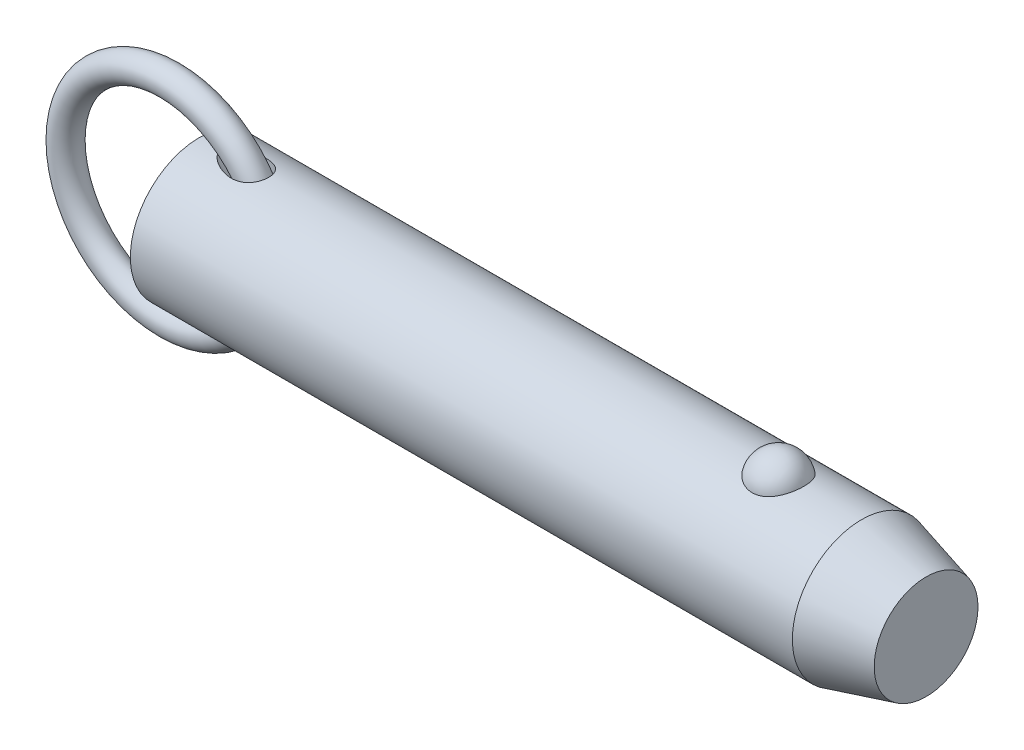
ISO-10303-21;
HEADER;
FILE_DESCRIPTION(('STEP AP214'),'2;1');
FILE_NAME('part.step','',(''),(''),'','','');
FILE_SCHEMA(('AUTOMOTIVE_DESIGN { 1 0 10303 214 1 1 1 1 }'));
ENDSEC;
DATA;
#1=APPLICATION_CONTEXT('core data for automotive mechanical design processes');
#2=APPLICATION_PROTOCOL_DEFINITION('international standard','automotive_design',2000,#1);
#3=PRODUCT_CONTEXT('',#1,'mechanical');
#4=PRODUCT('Part','Part','',(#3));
#5=PRODUCT_RELATED_PRODUCT_CATEGORY('part','',(#4));
#6=PRODUCT_DEFINITION_FORMATION('','',#4);
#7=PRODUCT_DEFINITION_CONTEXT('part definition',#1,'design');
#8=PRODUCT_DEFINITION('design','',#6,#7);
#9=PRODUCT_DEFINITION_SHAPE('','',#8);
#10=(LENGTH_UNIT() NAMED_UNIT(*) SI_UNIT(.MILLI.,.METRE.));
#11=(NAMED_UNIT(*) PLANE_ANGLE_UNIT() SI_UNIT($,.RADIAN.));
#12=(NAMED_UNIT(*) SI_UNIT($,.STERADIAN.) SOLID_ANGLE_UNIT());
#13=UNCERTAINTY_MEASURE_WITH_UNIT(LENGTH_MEASURE(1.E-05),#10,'distance_accuracy_value','');
#14=(GEOMETRIC_REPRESENTATION_CONTEXT(3) GLOBAL_UNCERTAINTY_ASSIGNED_CONTEXT((#13)) GLOBAL_UNIT_ASSIGNED_CONTEXT((#10,
#11,#12)) REPRESENTATION_CONTEXT('',''));
#15=CARTESIAN_POINT('',(0.,0.,0.));
#16=DIRECTION('',(0.,0.,1.));
#17=DIRECTION('',(1.,0.,0.));
#18=AXIS2_PLACEMENT_3D('',#15,#16,#17);
#19=CARTESIAN_POINT('',(-5.53898640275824,0.,0.));
#20=DIRECTION('',(0.,0.,1.));
#21=DIRECTION('',(1.,0.,0.));
#22=AXIS2_PLACEMENT_3D('',#19,#20,#21);
#23=TOROIDAL_SURFACE('',#22,19.05,2.54);
#24=CARTESIAN_POINT('',(16.0510135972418,0.,0.));
#25=VERTEX_POINT('',#24);
#26=VERTEX_LOOP('',#25);
#27=FACE_BOUND('',#26,.T.);
#28=ADVANCED_FACE('P0_F12',(#27),#23,.T.);
#29=CLOSED_SHELL('',(#28));
#30=MANIFOLD_SOLID_BREP('P0_B1',#29);
#31=CARTESIAN_POINT('',(0.,0.,0.));
#32=DIRECTION('',(1.,0.,0.));
#33=DIRECTION('',(0.,0.,-1.));
#34=AXIS2_PLACEMENT_3D('',#31,#32,#33);
#35=CYLINDRICAL_SURFACE('',#34,12.7);
#36=CARTESIAN_POINT('',(121.500738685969,0.,0.));
#37=DIRECTION('',(1.,0.,0.));
#38=DIRECTION('',(0.,0.,-1.));
#39=AXIS2_PLACEMENT_3D('',#36,#37,#38);
#40=CIRCLE('',#39,12.7);
#41=CARTESIAN_POINT('',(121.500738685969,0.,-12.7));
#42=VERTEX_POINT('',#41);
#43=EDGE_CURVE('P1_E89',#42,#42,#40,.T.);
#44=ORIENTED_EDGE('',*,*,#43,.F.);
#45=EDGE_LOOP('',(#44));
#46=FACE_BOUND('',#45,.T.);
#47=CARTESIAN_POINT('',(0.,0.,0.));
#48=DIRECTION('',(1.,0.,0.));
#49=DIRECTION('',(0.,0.,-1.));
#50=AXIS2_PLACEMENT_3D('',#47,#48,#49);
#51=CIRCLE('',#50,12.7);
#52=CARTESIAN_POINT('',(0.,0.,-12.7));
#53=VERTEX_POINT('',#52);
#54=EDGE_CURVE('P1_E52',#53,#53,#51,.T.);
#55=ORIENTED_EDGE('',*,*,#54,.T.);
#56=EDGE_LOOP('',(#55));
#57=FACE_BOUND('',#56,.T.);
#58=CARTESIAN_POINT('',(106.260042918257,11.7500437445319,4.81938502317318));
#59=CARTESIAN_POINT('',(106.135088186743,11.7500430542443,4.81938571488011));
#60=CARTESIAN_POINT('',(106.010144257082,11.7520975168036,4.81438658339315));
#61=CARTESIAN_POINT('',(105.761142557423,11.760253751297,4.79442904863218));
#62=CARTESIAN_POINT('',(105.637085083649,11.7663568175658,4.77946746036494));
#63=CARTESIAN_POINT('',(105.390901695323,11.7824262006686,4.7397141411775));
#64=CARTESIAN_POINT('',(105.268774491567,11.7923898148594,4.71492928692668));
#65=CARTESIAN_POINT('',(105.027187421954,11.8158938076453,4.65571340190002));
#66=CARTESIAN_POINT('',(104.90772859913,11.8294355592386,4.6212786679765));
#67=CARTESIAN_POINT('',(104.672557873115,11.8596812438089,4.54309502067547));
#68=CARTESIAN_POINT('',(104.556839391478,11.8763792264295,4.49936361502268));
#69=CARTESIAN_POINT('',(104.329653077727,11.9124878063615,4.40287235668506));
#70=CARTESIAN_POINT('',(104.218186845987,11.9318994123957,4.35010914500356));
#71=CARTESIAN_POINT('',(103.891278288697,11.9934256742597,4.17881316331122));
#72=CARTESIAN_POINT('',(103.683127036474,12.038858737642,4.04720756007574));
#73=CARTESIAN_POINT('',(103.285850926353,12.1352173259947,3.748564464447));
#74=CARTESIAN_POINT('',(103.097443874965,12.1862630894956,3.58061821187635));
#75=CARTESIAN_POINT('',(102.750521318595,12.2875163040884,3.21600758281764));
#76=CARTESIAN_POINT('',(102.592011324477,12.3377235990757,3.0193379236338));
#77=CARTESIAN_POINT('',(102.30168878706,12.434492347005,2.592916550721));
#78=CARTESIAN_POINT('',(102.171376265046,12.4807925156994,2.36208286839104));
#79=CARTESIAN_POINT('',(101.949407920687,12.5623454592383,1.88070399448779));
#80=CARTESIAN_POINT('',(101.857755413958,12.5975972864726,1.63015711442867));
#81=CARTESIAN_POINT('',(101.714046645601,12.6538414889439,1.1129886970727));
#82=CARTESIAN_POINT('',(101.662499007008,12.6746503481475,0.846205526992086));
#83=CARTESIAN_POINT('',(101.601977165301,12.699153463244,0.307085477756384));
#84=CARTESIAN_POINT('',(101.593001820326,12.7028481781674,0.0347487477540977));
#85=CARTESIAN_POINT('',(101.617731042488,12.6927785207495,-0.506073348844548));
#86=CARTESIAN_POINT('',(101.651189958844,12.6791146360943,-0.77457186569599));
#87=CARTESIAN_POINT('',(101.759687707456,12.635882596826,-1.30170246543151));
#88=CARTESIAN_POINT('',(101.83472729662,12.606314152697,-1.5603343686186));
#89=CARTESIAN_POINT('',(102.02500006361,12.5342328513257,-2.06083899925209));
#90=CARTESIAN_POINT('',(102.140287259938,12.4917026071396,-2.3026886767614));
#91=CARTESIAN_POINT('',(102.408704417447,12.3981123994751,-2.76259600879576));
#92=CARTESIAN_POINT('',(102.561837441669,12.3470517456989,-2.98065173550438));
#93=CARTESIAN_POINT('',(102.903507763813,12.2416045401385,-3.38786328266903));
#94=CARTESIAN_POINT('',(103.092201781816,12.1872040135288,-3.57688418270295));
#95=CARTESIAN_POINT('',(103.500239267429,12.0814086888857,-3.91941073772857));
#96=CARTESIAN_POINT('',(103.719580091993,12.0300136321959,-4.07291945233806));
#97=CARTESIAN_POINT('',(104.178375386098,11.9373542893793,-4.33691289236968));
#98=CARTESIAN_POINT('',(104.417304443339,11.8958982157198,-4.44824125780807));
#99=CARTESIAN_POINT('',(104.91243761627,11.8268116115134,-4.62881985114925));
#100=CARTESIAN_POINT('',(105.168635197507,11.7991758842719,-4.69808589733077));
#101=CARTESIAN_POINT('',(105.677164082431,11.7622209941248,-4.78983181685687));
#102=CARTESIAN_POINT('',(105.929041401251,11.7520502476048,-4.81449025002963));
#103=CARTESIAN_POINT('',(106.433573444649,11.7485796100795,-4.82295735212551));
#104=CARTESIAN_POINT('',(106.686228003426,11.7552763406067,-4.80677420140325));
#105=CARTESIAN_POINT('',(107.176834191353,11.7842584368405,-4.73525430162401));
#106=CARTESIAN_POINT('',(107.414998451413,11.8060486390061,-4.68116061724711));
#107=CARTESIAN_POINT('',(107.878489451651,11.8622750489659,-4.53678133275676));
#108=CARTESIAN_POINT('',(108.103815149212,11.8967122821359,-4.44649279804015));
#109=CARTESIAN_POINT('',(108.540801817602,11.9754603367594,-4.2298761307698));
#110=CARTESIAN_POINT('',(108.752057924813,12.0199699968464,-4.10280539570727));
#111=CARTESIAN_POINT('',(109.150601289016,12.1138028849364,-3.81685409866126));
#112=CARTESIAN_POINT('',(109.337883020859,12.163127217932,-3.65796622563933));
#113=CARTESIAN_POINT('',(109.693350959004,12.2642343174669,-3.30364864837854));
#114=CARTESIAN_POINT('',(109.860111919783,12.3160165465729,-3.10678783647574));
#115=CARTESIAN_POINT('',(110.159579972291,12.4142566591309,-2.68748409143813));
#116=CARTESIAN_POINT('',(110.292280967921,12.4607135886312,-2.46503658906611));
#117=CARTESIAN_POINT('',(110.524691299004,12.5450236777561,-1.9928951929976));
#118=CARTESIAN_POINT('',(110.623215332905,12.5825557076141,-1.7425591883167));
#119=CARTESIAN_POINT('',(110.779227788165,12.6431720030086,-1.22773734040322));
#120=CARTESIAN_POINT('',(110.836715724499,12.6662560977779,-0.963251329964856));
#121=CARTESIAN_POINT('',(110.909544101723,12.6956486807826,-0.427355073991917));
#122=CARTESIAN_POINT('',(110.924837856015,12.7019385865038,-0.155937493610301));
#123=CARTESIAN_POINT('',(110.912779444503,12.6970201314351,0.385928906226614));
#124=CARTESIAN_POINT('',(110.88542805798,12.6858120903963,0.656377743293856));
#125=CARTESIAN_POINT('',(110.813060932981,12.6568455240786,1.05454017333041));
#126=CARTESIAN_POINT('',(110.783796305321,12.6451962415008,1.18577850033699));
#127=CARTESIAN_POINT('',(110.715022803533,12.6181819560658,1.4451380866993));
#128=CARTESIAN_POINT('',(110.675517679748,12.6028183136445,1.57326046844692));
#129=CARTESIAN_POINT('',(110.586439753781,12.5687547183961,1.82554978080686));
#130=CARTESIAN_POINT('',(110.536862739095,12.5500533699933,1.9497150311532));
#131=CARTESIAN_POINT('',(110.42792115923,12.5098093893,2.1931437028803));
#132=CARTESIAN_POINT('',(110.368560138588,12.4882677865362,2.31240887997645));
#133=CARTESIAN_POINT('',(110.23997128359,12.4427679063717,2.54593031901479));
#134=CARTESIAN_POINT('',(110.170688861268,12.4187964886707,2.66015396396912));
#135=CARTESIAN_POINT('',(110.022903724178,12.3691892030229,2.88202659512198));
#136=CARTESIAN_POINT('',(109.944404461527,12.3435539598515,2.98967802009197));
#137=CARTESIAN_POINT('',(109.778550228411,12.2912955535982,3.19774385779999));
#138=CARTESIAN_POINT('',(109.691191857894,12.2646720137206,3.29815546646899));
#139=CARTESIAN_POINT('',(109.508161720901,12.2111945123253,3.49095035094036));
#140=CARTESIAN_POINT('',(109.412493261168,12.1843406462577,3.58333679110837));
#141=CARTESIAN_POINT('',(109.213627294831,12.1312249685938,3.75922876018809));
#142=CARTESIAN_POINT('',(109.110450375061,12.104961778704,3.84275713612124));
#143=CARTESIAN_POINT('',(108.89701336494,12.0537284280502,4.00056406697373));
#144=CARTESIAN_POINT('',(108.786756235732,12.028757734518,4.07484645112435));
#145=CARTESIAN_POINT('',(108.559755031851,11.9808306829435,4.21367959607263));
#146=CARTESIAN_POINT('',(108.443006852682,11.9578756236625,4.27822410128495));
#147=CARTESIAN_POINT('',(108.20394258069,11.9147184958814,4.39698483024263));
#148=CARTESIAN_POINT('',(108.081628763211,11.894515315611,4.45120522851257));
#149=CARTESIAN_POINT('',(107.822952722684,11.8561129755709,4.55255353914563));
#150=CARTESIAN_POINT('',(107.686223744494,11.8381764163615,4.59884858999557));
#151=CARTESIAN_POINT('',(107.408608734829,11.8069093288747,4.67853897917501));
#152=CARTESIAN_POINT('',(107.267724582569,11.7935767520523,4.71194005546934));
#153=CARTESIAN_POINT('',(106.98309446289,11.7720277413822,4.76552188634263));
#154=CARTESIAN_POINT('',(106.839348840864,11.7638106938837,4.78570422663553));
#155=CARTESIAN_POINT('',(106.550411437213,11.7528195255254,4.81263433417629));
#156=CARTESIAN_POINT('',(106.405219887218,11.7500445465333,4.81938421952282));
#157=CARTESIAN_POINT('',(106.260042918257,11.7500437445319,4.81938502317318));
#158=B_SPLINE_CURVE_WITH_KNOTS('',3,(#58,#59,#60,#61,#62,#63,#64,#65,#66,#67,#68,#69,#70,#71,
#72,#73,#74,#75,#76,#77,#78,#79,#80,#81,#82,#83,#84,#85,#86,#87,#88,#89,#90,#91,#92,#93,#94,#95,
#96,#97,#98,#99,#100,#101,#102,#103,#104,#105,#106,#107,#108,#109,#110,#111,#112,#113,#114,#115,
#116,#117,#118,#119,#120,#121,#122,#123,#124,#125,#126,#127,#128,#129,#130,#131,#132,#133,#134,
#135,#136,#137,#138,#139,#140,#141,#142,#143,#144,#145,#146,#147,#148,#149,#150,#151,#152,#153,
#154,#155,#156,#157),.UNSPECIFIED.,.T.,.F.,(4,2,2,2,2,2,2,2,2,2,2,2,2,2,2,2,2,2,2,2,2,2,2,2,2,2,
2,2,2,2,2,2,2,2,2,2,2,2,2,2,2,2,2,2,2,2,2,2,2,4),(0.,0.374729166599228,0.749578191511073,
1.12416526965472,1.49889629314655,1.87292776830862,2.24709865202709,2.99481328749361,
3.76399449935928,4.53331735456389,5.3368391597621,6.14042986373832,6.95405296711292,
7.76765424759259,8.57656703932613,9.38549455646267,10.1955119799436,11.0055949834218,
11.8193353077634,12.6330054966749,13.4294141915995,14.2255231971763,14.9815786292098,
15.7374826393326,16.4696948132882,17.2019663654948,17.9501979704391,18.6986017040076,
19.484470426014,20.2704797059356,21.0815215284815,21.8925729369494,22.7045213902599,
23.5164550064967,23.9209608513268,24.3253187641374,24.7298461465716,25.1342272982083,
25.54092555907,25.9474719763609,26.3541750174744,26.7607169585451,27.1661834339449,
27.5714814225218,27.9770386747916,28.3824315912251,28.8181206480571,29.2536155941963,
29.6890582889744,30.1244323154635),.UNSPECIFIED.);
#159=CARTESIAN_POINT('',(106.260042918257,11.7500437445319,4.81938502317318));
#160=VERTEX_POINT('',#159);
#161=EDGE_CURVE('P1_E80',#160,#160,#158,.T.);
#162=ORIENTED_EDGE('',*,*,#161,.T.);
#163=EDGE_LOOP('',(#162));
#164=FACE_BOUND('',#163,.T.);
#165=CARTESIAN_POINT('',(-5.53898640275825,0.,0.));
#166=DIRECTION('',(0.796400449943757,-0.604769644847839,0.));
#167=DIRECTION('',(0.604769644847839,0.796400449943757,0.));
#168=AXIS2_PLACEMENT_3D('',#165,#166,#167);
#169=ELLIPSE('',#168,15.9467514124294,12.7);
#170=CARTESIAN_POINT('',(4.09482149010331,12.6864319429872,0.5868939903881));
#171=VERTEX_POINT('',#170);
#172=CARTESIAN_POINT('',(4.09482149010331,12.6864319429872,-0.5868939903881));
#173=VERTEX_POINT('',#172);
#174=EDGE_CURVE('P1_E47',#171,#173,#169,.F.);
#175=ORIENTED_EDGE('',*,*,#174,.T.);
#176=CARTESIAN_POINT('',(4.06153170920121,12.6905758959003,-0.489166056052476));
#177=CARTESIAN_POINT('',(4.08111374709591,12.6881366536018,-0.552489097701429));
#178=CARTESIAN_POINT('',(4.10417851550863,12.6852663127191,-0.614604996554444));
#179=CARTESIAN_POINT('',(4.15628434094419,12.6787965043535,-0.736067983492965));
#180=CARTESIAN_POINT('',(4.18531032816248,12.6751988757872,-0.795421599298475));
#181=CARTESIAN_POINT('',(4.27911159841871,12.6636052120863,-0.967590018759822));
#182=CARTESIAN_POINT('',(4.35123408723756,12.654730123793,-1.07635920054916));
#183=CARTESIAN_POINT('',(4.49106800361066,12.6376715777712,-1.25922957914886));
#184=CARTESIAN_POINT('',(4.55601066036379,12.6297947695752,-1.33556751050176));
#185=CARTESIAN_POINT('',(4.69223626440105,12.6134116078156,-1.48232741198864));
#186=CARTESIAN_POINT('',(4.76352147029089,12.6049050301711,-1.55274725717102));
#187=CARTESIAN_POINT('',(4.91163946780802,12.587417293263,-1.68868704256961));
#188=CARTESIAN_POINT('',(4.98851399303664,12.5784327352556,-1.75416062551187));
#189=CARTESIAN_POINT('',(5.14630057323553,12.560235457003,-1.88003275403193));
#190=CARTESIAN_POINT('',(5.22721398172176,12.5510226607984,-1.94042957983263));
#191=CARTESIAN_POINT('',(5.45368877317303,12.5256514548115,-2.09966332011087));
#192=CARTESIAN_POINT('',(5.60261616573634,12.5094182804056,-2.19371988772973));
#193=CARTESIAN_POINT('',(5.90795545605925,12.4774211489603,-2.36893890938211));
#194=CARTESIAN_POINT('',(6.064372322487,12.4616575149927,-2.45009264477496));
#195=CARTESIAN_POINT('',(6.3830613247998,12.431227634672,-2.60008249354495));
#196=CARTESIAN_POINT('',(6.54533237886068,12.4165611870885,-2.66892086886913));
#197=CARTESIAN_POINT('',(6.87462618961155,12.3889351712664,-2.79435199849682));
#198=CARTESIAN_POINT('',(7.04164773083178,12.3759751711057,-2.8509478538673));
#199=CARTESIAN_POINT('',(7.38726647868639,12.3518460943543,-2.95377962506));
#200=CARTESIAN_POINT('',(7.56604577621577,12.3407843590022,-2.99943209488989));
#201=CARTESIAN_POINT('',(7.92698692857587,12.3219309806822,-3.07596683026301));
#202=CARTESIAN_POINT('',(8.10914972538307,12.314140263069,-3.10684491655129));
#203=CARTESIAN_POINT('',(8.475114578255,12.3025918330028,-3.152268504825));
#204=CARTESIAN_POINT('',(8.65890979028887,12.2988216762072,-3.16686440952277));
#205=CARTESIAN_POINT('',(9.0269608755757,12.2959421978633,-3.17802250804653));
#206=CARTESIAN_POINT('',(9.21121628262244,12.2968292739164,-3.17459864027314));
#207=CARTESIAN_POINT('',(9.61636263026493,12.3045198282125,-3.14471110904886));
#208=CARTESIAN_POINT('',(9.83695552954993,12.3125080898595,-3.1136323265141));
#209=CARTESIAN_POINT('',(10.1619126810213,12.3303028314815,-3.04206574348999));
#210=CARTESIAN_POINT('',(10.2692747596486,12.3372061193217,-3.01403983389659));
#211=CARTESIAN_POINT('',(10.4811758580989,12.3528538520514,-2.94925947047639));
#212=CARTESIAN_POINT('',(10.5857162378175,12.361597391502,-2.91250930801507));
#213=CARTESIAN_POINT('',(10.7921321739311,12.3808585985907,-2.82951748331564));
#214=CARTESIAN_POINT('',(10.8939665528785,12.3913944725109,-2.78317723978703));
#215=CARTESIAN_POINT('',(11.0926118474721,12.4138762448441,-2.68112002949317));
#216=CARTESIAN_POINT('',(11.1894254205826,12.4258213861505,-2.6254080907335));
#217=CARTESIAN_POINT('',(11.3768740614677,12.4507225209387,-2.5046565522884));
#218=CARTESIAN_POINT('',(11.46751150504,12.4636781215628,-2.43962056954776));
#219=CARTESIAN_POINT('',(11.6414572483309,12.4901070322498,-2.30048560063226));
#220=CARTESIAN_POINT('',(11.7247669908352,12.5035802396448,-2.22638840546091));
#221=CARTESIAN_POINT('',(11.8713131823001,12.5285000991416,-2.08117367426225));
#222=CARTESIAN_POINT('',(11.9357009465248,12.5399538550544,-2.01121596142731));
#223=CARTESIAN_POINT('',(12.0576805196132,12.5624496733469,-1.86555293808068));
#224=CARTESIAN_POINT('',(12.1152732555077,12.5734917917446,-1.78984841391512));
#225=CARTESIAN_POINT('',(12.223073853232,12.5947858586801,-1.63327883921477));
#226=CARTESIAN_POINT('',(12.2732844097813,12.6050380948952,-1.55241568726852));
#227=CARTESIAN_POINT('',(12.3658430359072,12.6243983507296,-1.3862126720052));
#228=CARTESIAN_POINT('',(12.4081916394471,12.6335064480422,-1.30087311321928));
#229=CARTESIAN_POINT('',(12.5150098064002,12.6569076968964,-1.05702619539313));
#230=CARTESIAN_POINT('',(12.5703399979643,12.6695746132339,-0.894232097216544));
#231=CARTESIAN_POINT('',(12.6526225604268,12.6886816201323,-0.561391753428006));
#232=CARTESIAN_POINT('',(12.6795825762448,12.6951233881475,-0.391347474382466));
#233=CARTESIAN_POINT('',(12.7041016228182,12.7009766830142,-0.0537636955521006));
#234=CARTESIAN_POINT('',(12.7024538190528,12.7005778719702,0.113714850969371));
#235=CARTESIAN_POINT('',(12.6717240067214,12.6932548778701,0.445979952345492));
#236=CARTESIAN_POINT('',(12.6426435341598,12.6863310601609,0.610766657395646));
#237=CARTESIAN_POINT('',(12.5579769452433,12.6667465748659,0.932429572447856));
#238=CARTESIAN_POINT('',(12.5024793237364,12.6541050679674,1.08933027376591));
#239=CARTESIAN_POINT('',(12.3665691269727,12.6244558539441,1.39146752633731));
#240=CARTESIAN_POINT('',(12.2861577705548,12.6074483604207,1.536704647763));
#241=CARTESIAN_POINT('',(12.1018203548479,12.5706804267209,1.81319588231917));
#242=CARTESIAN_POINT('',(11.9976588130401,12.5508932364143,1.94428915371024));
#243=CARTESIAN_POINT('',(11.7695265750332,12.5107540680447,2.18776051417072));
#244=CARTESIAN_POINT('',(11.6455540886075,12.4904020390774,2.30013691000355));
#245=CARTESIAN_POINT('',(11.3759347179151,12.4502278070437,2.50870972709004));
#246=CARTESIAN_POINT('',(11.2295880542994,12.4304654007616,2.60400962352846));
#247=CARTESIAN_POINT('',(10.9239803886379,12.3941696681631,2.7716292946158));
#248=CARTESIAN_POINT('',(10.7647152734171,12.3776373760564,2.84394171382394));
#249=CARTESIAN_POINT('',(10.4192039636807,12.3473062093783,2.9730352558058));
#250=CARTESIAN_POINT('',(10.231933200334,12.3340204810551,3.02717164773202));
#251=CARTESIAN_POINT('',(9.85152982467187,12.3134301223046,3.10986173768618));
#252=CARTESIAN_POINT('',(9.65839336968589,12.3061295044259,3.13839827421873));
#253=CARTESIAN_POINT('',(9.31022514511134,12.2982822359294,3.16897517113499));
#254=CARTESIAN_POINT('',(9.15555718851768,12.2966525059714,3.17526894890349));
#255=CARTESIAN_POINT('',(8.8461894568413,12.2967963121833,3.17471335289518));
#256=CARTESIAN_POINT('',(8.69148970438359,12.2985715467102,3.16785742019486));
#257=CARTESIAN_POINT('',(8.38280471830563,12.3051648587,3.14214692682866));
#258=CARTESIAN_POINT('',(8.22882218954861,12.3099904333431,3.12326280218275));
#259=CARTESIAN_POINT('',(7.92276070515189,12.3222644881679,3.07448013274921));
#260=CARTESIAN_POINT('',(7.77068148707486,12.3297126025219,3.04458312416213));
#261=CARTESIAN_POINT('',(7.46452663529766,12.3470493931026,2.97350781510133));
#262=CARTESIAN_POINT('',(7.31052714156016,12.3570043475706,2.93201910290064));
#263=CARTESIAN_POINT('',(7.00579083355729,12.3787609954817,2.83876185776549));
#264=CARTESIAN_POINT('',(6.85505451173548,12.3905629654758,2.78699178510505));
#265=CARTESIAN_POINT('',(6.55781208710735,12.415528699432,2.67357744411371));
#266=CARTESIAN_POINT('',(6.4112978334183,12.4286895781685,2.61195394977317));
#267=CARTESIAN_POINT('',(6.12302950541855,12.4559398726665,2.47874512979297));
#268=CARTESIAN_POINT('',(5.98127390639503,12.4700289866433,2.40716303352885));
#269=CARTESIAN_POINT('',(5.67073126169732,12.5020754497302,2.23550426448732));
#270=CARTESIAN_POINT('',(5.50343839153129,12.5201625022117,2.13268685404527));
#271=CARTESIAN_POINT('',(5.2614761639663,12.5471537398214,1.96522579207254));
#272=CARTESIAN_POINT('',(5.18224299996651,12.5561365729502,1.90713440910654));
#273=CARTESIAN_POINT('',(5.02746475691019,12.573912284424,1.78618989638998));
#274=CARTESIAN_POINT('',(4.95191912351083,12.5827051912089,1.72333748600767));
#275=CARTESIAN_POINT('',(4.81787163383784,12.598469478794,1.60360864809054));
#276=CARTESIAN_POINT('',(4.75865966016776,12.6054958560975,1.54753994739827));
#277=CARTESIAN_POINT('',(4.64406285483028,12.6191906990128,1.43158546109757));
#278=CARTESIAN_POINT('',(4.58867926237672,12.6258590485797,1.37169845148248));
#279=CARTESIAN_POINT('',(4.43014912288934,12.6450546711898,1.1865667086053));
#280=CARTESIAN_POINT('',(4.33372726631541,12.6568788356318,1.05507993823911));
#281=CARTESIAN_POINT('',(4.21252055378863,12.6718304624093,0.848052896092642));
#282=CARTESIAN_POINT('',(4.17660155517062,12.6762773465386,0.779100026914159));
#283=CARTESIAN_POINT('',(4.11264979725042,12.6842122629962,0.637080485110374));
#284=CARTESIAN_POINT('',(4.08466792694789,12.6876941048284,0.563990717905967));
#285=CARTESIAN_POINT('',(4.06153170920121,12.6905758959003,0.489166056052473));
#286=B_SPLINE_CURVE_WITH_KNOTS('',3,(#176,#177,#178,#179,#180,#181,#182,#183,#184,#185,#186,
#187,#188,#189,#190,#191,#192,#193,#194,#195,#196,#197,#198,#199,#200,#201,#202,#203,#204,#205,
#206,#207,#208,#209,#210,#211,#212,#213,#214,#215,#216,#217,#218,#219,#220,#221,#222,#223,#224,
#225,#226,#227,#228,#229,#230,#231,#232,#233,#234,#235,#236,#237,#238,#239,#240,#241,#242,#243,
#244,#245,#246,#247,#248,#249,#250,#251,#252,#253,#254,#255,#256,#257,#258,#259,#260,#261,#262,
#263,#264,#265,#266,#267,#268,#269,#270,#271,#272,#273,#274,#275,#276,#277,#278,#279,#280,#281,
#282,#283,#284,#285),.UNSPECIFIED.,.F.,.F.,(4,2,2,2,2,2,2,2,2,2,2,2,2,2,2,2,2,2,2,2,2,2,2,2,2,2,
2,2,2,2,2,2,2,2,2,2,2,2,2,2,2,2,2,2,2,2,2,2,2,2,2,2,2,2,4),(0.,0.198708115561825,
0.396919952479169,0.787580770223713,1.08882492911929,1.39017679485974,1.69407136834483,
1.99806847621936,2.52793143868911,3.0581509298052,3.588272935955,4.11826050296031,
4.67218806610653,5.22627222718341,5.77863637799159,6.33057333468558,6.99657211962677,
7.3297741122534,7.662812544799,7.99946156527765,8.33593054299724,8.67226935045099,
9.0085417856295,9.29544181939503,9.58230266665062,9.86905853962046,10.1557949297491,
10.6702338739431,11.1845341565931,11.6845985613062,12.1846349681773,12.6830079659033,
13.1813565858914,13.68487951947,14.1884479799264,14.713533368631,15.2387866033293,
15.8228373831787,16.407279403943,16.8710810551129,17.3351141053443,17.8002921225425,
18.2654052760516,18.7444169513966,19.2235004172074,19.7015868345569,20.1795185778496,
20.7699825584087,21.0658110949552,21.3615950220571,21.606957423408,21.8523988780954,
22.3397467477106,22.5729183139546,22.8075527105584),.UNSPECIFIED.);
#287=EDGE_CURVE('P1_E51',#173,#171,#286,.T.);
#288=ORIENTED_EDGE('',*,*,#287,.T.);
#289=EDGE_LOOP('',(#175,#288));
#290=FACE_BOUND('',#289,.T.);
#291=CARTESIAN_POINT('',(-5.53898640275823,0.,0.));
#292=DIRECTION('',(-0.796400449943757,-0.604769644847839,0.));
#293=DIRECTION('',(0.604769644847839,-0.796400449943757,0.));
#294=AXIS2_PLACEMENT_3D('',#291,#292,#293);
#295=ELLIPSE('',#294,15.9467514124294,12.7);
#296=CARTESIAN_POINT('',(4.09482149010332,-12.6864319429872,0.58689399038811));
#297=VERTEX_POINT('',#296);
#298=CARTESIAN_POINT('',(4.09482149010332,-12.6864319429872,-0.58689399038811));
#299=VERTEX_POINT('',#298);
#300=EDGE_CURVE('P1_E28',#297,#299,#295,.F.);
#301=ORIENTED_EDGE('',*,*,#300,.F.);
#302=CARTESIAN_POINT('',(4.06153170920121,-12.6905758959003,0.489166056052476));
#303=CARTESIAN_POINT('',(4.08111374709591,-12.6881366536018,0.552489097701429));
#304=CARTESIAN_POINT('',(4.10417851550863,-12.6852663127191,0.614604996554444));
#305=CARTESIAN_POINT('',(4.15628434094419,-12.6787965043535,0.736067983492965));
#306=CARTESIAN_POINT('',(4.18531032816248,-12.6751988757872,0.795421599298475));
#307=CARTESIAN_POINT('',(4.27911159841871,-12.6636052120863,0.967590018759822));
#308=CARTESIAN_POINT('',(4.35123408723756,-12.654730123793,1.07635920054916));
#309=CARTESIAN_POINT('',(4.49106800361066,-12.6376715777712,1.25922957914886));
#310=CARTESIAN_POINT('',(4.55601066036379,-12.6297947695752,1.33556751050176));
#311=CARTESIAN_POINT('',(4.69223626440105,-12.6134116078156,1.48232741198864));
#312=CARTESIAN_POINT('',(4.76352147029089,-12.6049050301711,1.55274725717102));
#313=CARTESIAN_POINT('',(4.91163946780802,-12.587417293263,1.68868704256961));
#314=CARTESIAN_POINT('',(4.98851399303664,-12.5784327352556,1.75416062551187));
#315=CARTESIAN_POINT('',(5.14630057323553,-12.560235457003,1.88003275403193));
#316=CARTESIAN_POINT('',(5.22721398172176,-12.5510226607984,1.94042957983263));
#317=CARTESIAN_POINT('',(5.45368877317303,-12.5256514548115,2.09966332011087));
#318=CARTESIAN_POINT('',(5.60261616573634,-12.5094182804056,2.19371988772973));
#319=CARTESIAN_POINT('',(5.90795545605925,-12.4774211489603,2.36893890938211));
#320=CARTESIAN_POINT('',(6.064372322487,-12.4616575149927,2.45009264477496));
#321=CARTESIAN_POINT('',(6.3830613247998,-12.431227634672,2.60008249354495));
#322=CARTESIAN_POINT('',(6.54533237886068,-12.4165611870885,2.66892086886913));
#323=CARTESIAN_POINT('',(6.87462618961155,-12.3889351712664,2.79435199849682));
#324=CARTESIAN_POINT('',(7.04164773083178,-12.3759751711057,2.8509478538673));
#325=CARTESIAN_POINT('',(7.38726647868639,-12.3518460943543,2.95377962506));
#326=CARTESIAN_POINT('',(7.56604577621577,-12.3407843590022,2.99943209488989));
#327=CARTESIAN_POINT('',(7.92698692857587,-12.3219309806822,3.07596683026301));
#328=CARTESIAN_POINT('',(8.10914972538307,-12.314140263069,3.10684491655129));
#329=CARTESIAN_POINT('',(8.475114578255,-12.3025918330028,3.152268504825));
#330=CARTESIAN_POINT('',(8.65890979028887,-12.2988216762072,3.16686440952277));
#331=CARTESIAN_POINT('',(9.0269608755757,-12.2959421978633,3.17802250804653));
#332=CARTESIAN_POINT('',(9.21121628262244,-12.2968292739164,3.17459864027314));
#333=CARTESIAN_POINT('',(9.61636263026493,-12.3045198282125,3.14471110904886));
#334=CARTESIAN_POINT('',(9.83695552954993,-12.3125080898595,3.1136323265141));
#335=CARTESIAN_POINT('',(10.1619126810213,-12.3303028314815,3.04206574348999));
#336=CARTESIAN_POINT('',(10.2692747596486,-12.3372061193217,3.01403983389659));
#337=CARTESIAN_POINT('',(10.4811758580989,-12.3528538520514,2.94925947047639));
#338=CARTESIAN_POINT('',(10.5857162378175,-12.361597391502,2.91250930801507));
#339=CARTESIAN_POINT('',(10.7921321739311,-12.3808585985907,2.82951748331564));
#340=CARTESIAN_POINT('',(10.8939665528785,-12.3913944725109,2.78317723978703));
#341=CARTESIAN_POINT('',(11.0926118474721,-12.4138762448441,2.68112002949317));
#342=CARTESIAN_POINT('',(11.1894254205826,-12.4258213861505,2.6254080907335));
#343=CARTESIAN_POINT('',(11.3768740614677,-12.4507225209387,2.5046565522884));
#344=CARTESIAN_POINT('',(11.46751150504,-12.4636781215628,2.43962056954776));
#345=CARTESIAN_POINT('',(11.6414572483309,-12.4901070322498,2.30048560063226));
#346=CARTESIAN_POINT('',(11.7247669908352,-12.5035802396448,2.22638840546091));
#347=CARTESIAN_POINT('',(11.8713131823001,-12.5285000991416,2.08117367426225));
#348=CARTESIAN_POINT('',(11.9357009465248,-12.5399538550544,2.01121596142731));
#349=CARTESIAN_POINT('',(12.0576805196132,-12.5624496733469,1.86555293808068));
#350=CARTESIAN_POINT('',(12.1152732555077,-12.5734917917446,1.78984841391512));
#351=CARTESIAN_POINT('',(12.223073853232,-12.5947858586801,1.63327883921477));
#352=CARTESIAN_POINT('',(12.2732844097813,-12.6050380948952,1.55241568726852));
#353=CARTESIAN_POINT('',(12.3658430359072,-12.6243983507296,1.3862126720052));
#354=CARTESIAN_POINT('',(12.4081916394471,-12.6335064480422,1.30087311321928));
#355=CARTESIAN_POINT('',(12.5150098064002,-12.6569076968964,1.05702619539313));
#356=CARTESIAN_POINT('',(12.5703399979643,-12.6695746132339,0.894232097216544));
#357=CARTESIAN_POINT('',(12.6526225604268,-12.6886816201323,0.561391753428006));
#358=CARTESIAN_POINT('',(12.6795825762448,-12.6951233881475,0.391347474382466));
#359=CARTESIAN_POINT('',(12.7041016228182,-12.7009766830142,0.0537636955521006));
#360=CARTESIAN_POINT('',(12.7024538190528,-12.7005778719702,-0.113714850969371));
#361=CARTESIAN_POINT('',(12.6717240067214,-12.6932548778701,-0.445979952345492));
#362=CARTESIAN_POINT('',(12.6426435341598,-12.6863310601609,-0.610766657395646));
#363=CARTESIAN_POINT('',(12.5579769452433,-12.6667465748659,-0.932429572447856));
#364=CARTESIAN_POINT('',(12.5024793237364,-12.6541050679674,-1.08933027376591));
#365=CARTESIAN_POINT('',(12.3665691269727,-12.6244558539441,-1.39146752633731));
#366=CARTESIAN_POINT('',(12.2861577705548,-12.6074483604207,-1.536704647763));
#367=CARTESIAN_POINT('',(12.1018203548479,-12.5706804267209,-1.81319588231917));
#368=CARTESIAN_POINT('',(11.9976588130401,-12.5508932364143,-1.94428915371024));
#369=CARTESIAN_POINT('',(11.7695265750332,-12.5107540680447,-2.18776051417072));
#370=CARTESIAN_POINT('',(11.6455540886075,-12.4904020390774,-2.30013691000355));
#371=CARTESIAN_POINT('',(11.3759347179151,-12.4502278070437,-2.50870972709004));
#372=CARTESIAN_POINT('',(11.2295880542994,-12.4304654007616,-2.60400962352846));
#373=CARTESIAN_POINT('',(10.9239803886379,-12.3941696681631,-2.7716292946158));
#374=CARTESIAN_POINT('',(10.7647152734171,-12.3776373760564,-2.84394171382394));
#375=CARTESIAN_POINT('',(10.4192039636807,-12.3473062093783,-2.9730352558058));
#376=CARTESIAN_POINT('',(10.231933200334,-12.3340204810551,-3.02717164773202));
#377=CARTESIAN_POINT('',(9.85152982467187,-12.3134301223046,-3.10986173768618));
#378=CARTESIAN_POINT('',(9.65839336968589,-12.3061295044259,-3.13839827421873));
#379=CARTESIAN_POINT('',(9.31022514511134,-12.2982822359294,-3.16897517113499));
#380=CARTESIAN_POINT('',(9.15555718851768,-12.2966525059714,-3.17526894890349));
#381=CARTESIAN_POINT('',(8.8461894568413,-12.2967963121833,-3.17471335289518));
#382=CARTESIAN_POINT('',(8.69148970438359,-12.2985715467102,-3.16785742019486));
#383=CARTESIAN_POINT('',(8.38280471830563,-12.3051648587,-3.14214692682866));
#384=CARTESIAN_POINT('',(8.22882218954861,-12.3099904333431,-3.12326280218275));
#385=CARTESIAN_POINT('',(7.92276070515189,-12.3222644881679,-3.07448013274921));
#386=CARTESIAN_POINT('',(7.77068148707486,-12.3297126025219,-3.04458312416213));
#387=CARTESIAN_POINT('',(7.46452663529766,-12.3470493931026,-2.97350781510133));
#388=CARTESIAN_POINT('',(7.31052714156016,-12.3570043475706,-2.93201910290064));
#389=CARTESIAN_POINT('',(7.00579083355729,-12.3787609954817,-2.83876185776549));
#390=CARTESIAN_POINT('',(6.85505451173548,-12.3905629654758,-2.78699178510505));
#391=CARTESIAN_POINT('',(6.55781208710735,-12.415528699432,-2.67357744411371));
#392=CARTESIAN_POINT('',(6.4112978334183,-12.4286895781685,-2.61195394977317));
#393=CARTESIAN_POINT('',(6.12302950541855,-12.4559398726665,-2.47874512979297));
#394=CARTESIAN_POINT('',(5.98127390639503,-12.4700289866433,-2.40716303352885));
#395=CARTESIAN_POINT('',(5.67073126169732,-12.5020754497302,-2.23550426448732));
#396=CARTESIAN_POINT('',(5.50343839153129,-12.5201625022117,-2.13268685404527));
#397=CARTESIAN_POINT('',(5.2614761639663,-12.5471537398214,-1.96522579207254));
#398=CARTESIAN_POINT('',(5.18224299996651,-12.5561365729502,-1.90713440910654));
#399=CARTESIAN_POINT('',(5.02746475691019,-12.573912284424,-1.78618989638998));
#400=CARTESIAN_POINT('',(4.95191912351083,-12.5827051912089,-1.72333748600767));
#401=CARTESIAN_POINT('',(4.81787163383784,-12.598469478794,-1.60360864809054));
#402=CARTESIAN_POINT('',(4.75865966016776,-12.6054958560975,-1.54753994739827));
#403=CARTESIAN_POINT('',(4.64406285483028,-12.6191906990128,-1.43158546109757));
#404=CARTESIAN_POINT('',(4.58867926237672,-12.6258590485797,-1.37169845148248));
#405=CARTESIAN_POINT('',(4.43014912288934,-12.6450546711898,-1.1865667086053));
#406=CARTESIAN_POINT('',(4.33372726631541,-12.6568788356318,-1.05507993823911));
#407=CARTESIAN_POINT('',(4.21252055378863,-12.6718304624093,-0.848052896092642));
#408=CARTESIAN_POINT('',(4.17660155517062,-12.6762773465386,-0.779100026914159));
#409=CARTESIAN_POINT('',(4.11264979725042,-12.6842122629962,-0.637080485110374));
#410=CARTESIAN_POINT('',(4.08466792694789,-12.6876941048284,-0.563990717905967));
#411=CARTESIAN_POINT('',(4.06153170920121,-12.6905758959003,-0.489166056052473));
#412=B_SPLINE_CURVE_WITH_KNOTS('',3,(#302,#303,#304,#305,#306,#307,#308,#309,#310,#311,#312,
#313,#314,#315,#316,#317,#318,#319,#320,#321,#322,#323,#324,#325,#326,#327,#328,#329,#330,#331,
#332,#333,#334,#335,#336,#337,#338,#339,#340,#341,#342,#343,#344,#345,#346,#347,#348,#349,#350,
#351,#352,#353,#354,#355,#356,#357,#358,#359,#360,#361,#362,#363,#364,#365,#366,#367,#368,#369,
#370,#371,#372,#373,#374,#375,#376,#377,#378,#379,#380,#381,#382,#383,#384,#385,#386,#387,#388,
#389,#390,#391,#392,#393,#394,#395,#396,#397,#398,#399,#400,#401,#402,#403,#404,#405,#406,#407,
#408,#409,#410,#411),.UNSPECIFIED.,.F.,.F.,(4,2,2,2,2,2,2,2,2,2,2,2,2,2,2,2,2,2,2,2,2,2,2,2,2,2,
2,2,2,2,2,2,2,2,2,2,2,2,2,2,2,2,2,2,2,2,2,2,2,2,2,2,2,2,4),(0.,0.198708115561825,
0.396919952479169,0.787580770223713,1.08882492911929,1.39017679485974,1.69407136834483,
1.99806847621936,2.52793143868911,3.0581509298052,3.588272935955,4.11826050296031,
4.67218806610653,5.22627222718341,5.77863637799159,6.33057333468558,6.99657211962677,
7.3297741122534,7.662812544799,7.99946156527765,8.33593054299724,8.67226935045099,
9.0085417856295,9.29544181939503,9.58230266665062,9.86905853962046,10.1557949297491,
10.6702338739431,11.1845341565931,11.6845985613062,12.1846349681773,12.6830079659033,
13.1813565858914,13.68487951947,14.1884479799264,14.713533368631,15.2387866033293,
15.8228373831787,16.407279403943,16.8710810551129,17.3351141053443,17.8002921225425,
18.2654052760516,18.7444169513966,19.2235004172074,19.7015868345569,20.1795185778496,
20.7699825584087,21.0658110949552,21.3615950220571,21.606957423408,21.8523988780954,
22.3397467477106,22.5729183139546,22.8075527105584),.UNSPECIFIED.);
#413=EDGE_CURVE('P1_E10',#297,#299,#412,.T.);
#414=ORIENTED_EDGE('',*,*,#413,.T.);
#415=EDGE_LOOP('',(#301,#414));
#416=FACE_BOUND('',#415,.T.);
#417=ADVANCED_FACE('P1_F15',(#46,#57,#164,#290,#416),#35,.T.);
#418=CARTESIAN_POINT('',(0.,0.,0.));
#419=DIRECTION('',(-1.,0.,0.));
#420=DIRECTION('',(0.,0.,1.));
#421=AXIS2_PLACEMENT_3D('',#418,#419,#420);
#422=PLANE('',#421);
#423=ORIENTED_EDGE('',*,*,#54,.F.);
#424=EDGE_LOOP('',(#423));
#425=FACE_BOUND('',#424,.T.);
#426=ADVANCED_FACE('P1_F17',(#425),#422,.T.);
#427=CARTESIAN_POINT('',(133.35,0.,0.));
#428=DIRECTION('',(-1.,0.,0.));
#429=DIRECTION('',(0.,0.,1.));
#430=AXIS2_PLACEMENT_3D('',#427,#428,#429);
#431=CONICAL_SURFACE('',#430,9.52500000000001,0.26179938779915);
#432=ORIENTED_EDGE('',*,*,#43,.T.);
#433=EDGE_LOOP('',(#432));
#434=FACE_BOUND('',#433,.T.);
#435=CARTESIAN_POINT('',(133.35,0.,0.));
#436=DIRECTION('',(1.,0.,0.));
#437=DIRECTION('',(0.,0.,-1.));
#438=AXIS2_PLACEMENT_3D('',#435,#436,#437);
#439=CIRCLE('',#438,9.52500000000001);
#440=CARTESIAN_POINT('',(133.35,0.,-9.52500000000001));
#441=VERTEX_POINT('',#440);
#442=EDGE_CURVE('P1_E86',#441,#441,#439,.T.);
#443=ORIENTED_EDGE('',*,*,#442,.F.);
#444=EDGE_LOOP('',(#443));
#445=FACE_BOUND('',#444,.T.);
#446=ADVANCED_FACE('P1_F105',(#434,#445),#431,.T.);
#447=CARTESIAN_POINT('',(133.35,9.52500000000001,0.));
#448=DIRECTION('',(1.,0.,0.));
#449=DIRECTION('',(0.,0.,-1.));
#450=AXIS2_PLACEMENT_3D('',#447,#448,#449);
#451=PLANE('',#450);
#452=ORIENTED_EDGE('',*,*,#442,.T.);
#453=EDGE_LOOP('',(#452));
#454=FACE_BOUND('',#453,.T.);
#455=ADVANCED_FACE('P1_F78',(#454),#451,.T.);
#456=CARTESIAN_POINT('',(106.260042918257,11.43,0.));
#457=DIRECTION('',(-1.,0.,0.));
#458=DIRECTION('',(0.,-1.,0.));
#459=AXIS2_PLACEMENT_3D('',#456,#457,#458);
#460=SPHERICAL_SURFACE('',#459,4.83);
#461=ORIENTED_EDGE('',*,*,#161,.F.);
#462=EDGE_LOOP('',(#461));
#463=FACE_BOUND('',#462,.T.);
#464=ADVANCED_FACE('P1_F71',(#463),#460,.T.);
#465=CARTESIAN_POINT('',(-5.53898640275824,0.,0.));
#466=DIRECTION('',(0.,0.,1.));
#467=DIRECTION('',(1.,0.,0.));
#468=AXIS2_PLACEMENT_3D('',#465,#466,#467);
#469=TOROIDAL_SURFACE('',#468,19.05,3.175);
#470=CARTESIAN_POINT('',(5.9818753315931,-15.1714285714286,0.));
#471=DIRECTION('',(-0.796400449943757,-0.604769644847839,0.));
#472=DIRECTION('',(0.604769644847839,-0.796400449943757,0.));
#473=AXIS2_PLACEMENT_3D('',#470,#471,#472);
#474=CIRCLE('',#473,3.175);
#475=EDGE_CURVE('P1_E34',#297,#299,#474,.T.);
#476=ORIENTED_EDGE('',*,*,#475,.T.);
#477=ORIENTED_EDGE('',*,*,#413,.F.);
#478=EDGE_LOOP('',(#476,#477));
#479=FACE_BOUND('',#478,.T.);
#480=CARTESIAN_POINT('',(5.9818753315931,15.1714285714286,0.));
#481=DIRECTION('',(0.796400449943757,-0.604769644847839,0.));
#482=DIRECTION('',(0.604769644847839,0.796400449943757,0.));
#483=AXIS2_PLACEMENT_3D('',#480,#481,#482);
#484=CIRCLE('',#483,3.175);
#485=EDGE_CURVE('P1_E41',#171,#173,#484,.T.);
#486=ORIENTED_EDGE('',*,*,#485,.F.);
#487=ORIENTED_EDGE('',*,*,#287,.F.);
#488=EDGE_LOOP('',(#486,#487));
#489=FACE_BOUND('',#488,.T.);
#490=ADVANCED_FACE('P1_F55',(#479,#489),#469,.F.);
#491=CARTESIAN_POINT('',(5.9818753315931,-15.1714285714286,0.));
#492=DIRECTION('',(-0.796400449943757,-0.604769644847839,0.));
#493=DIRECTION('',(0.604769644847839,-0.796400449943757,0.));
#494=AXIS2_PLACEMENT_3D('',#491,#492,#493);
#495=PLANE('',#494);
#496=ORIENTED_EDGE('',*,*,#300,.T.);
#497=ORIENTED_EDGE('',*,*,#475,.F.);
#498=EDGE_LOOP('',(#496,#497));
#499=FACE_BOUND('',#498,.T.);
#500=ADVANCED_FACE('P1_F70',(#499),#495,.F.);
#501=CARTESIAN_POINT('',(5.9818753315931,15.1714285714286,0.));
#502=DIRECTION('',(0.796400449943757,-0.604769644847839,0.));
#503=DIRECTION('',(0.604769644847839,0.796400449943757,0.));
#504=AXIS2_PLACEMENT_3D('',#501,#502,#503);
#505=PLANE('',#504);
#506=ORIENTED_EDGE('',*,*,#485,.T.);
#507=ORIENTED_EDGE('',*,*,#174,.F.);
#508=EDGE_LOOP('',(#506,#507));
#509=FACE_BOUND('',#508,.T.);
#510=ADVANCED_FACE('P1_F48',(#509),#505,.T.);
#511=CLOSED_SHELL('',(#417,#426,#446,#455,#464,#490,#500,#510));
#512=MANIFOLD_SOLID_BREP('P1_B1',#511);
#513=ADVANCED_BREP_SHAPE_REPRESENTATION('',(#18,#30,#512),#14);
#514=SHAPE_DEFINITION_REPRESENTATION(#9,#513);
ENDSEC;
END-ISO-10303-21;
